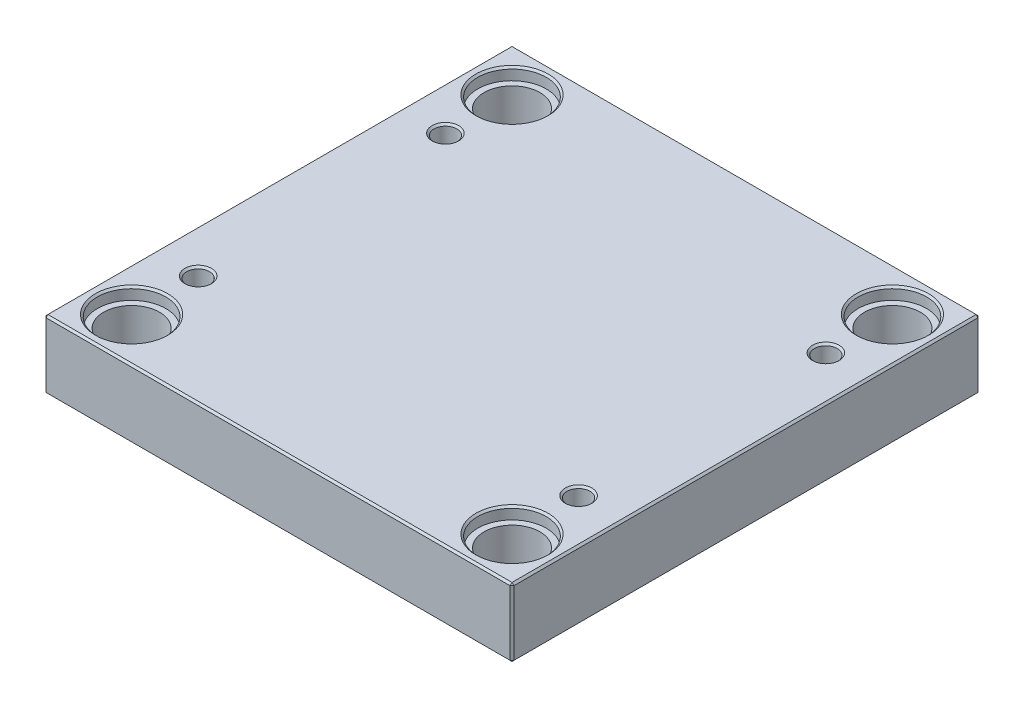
ISO-10303-21;
HEADER;
FILE_DESCRIPTION(('STEP AP214'),'2;1');
FILE_NAME('part.step','',(''),(''),'','','');
FILE_SCHEMA(('AUTOMOTIVE_DESIGN { 1 0 10303 214 1 1 1 1 }'));
ENDSEC;
DATA;
#1=APPLICATION_CONTEXT('core data for automotive mechanical design processes');
#2=APPLICATION_PROTOCOL_DEFINITION('international standard','automotive_design',2000,#1);
#3=PRODUCT_CONTEXT('',#1,'mechanical');
#4=PRODUCT('Part','Part','',(#3));
#5=PRODUCT_RELATED_PRODUCT_CATEGORY('part','',(#4));
#6=PRODUCT_DEFINITION_FORMATION('','',#4);
#7=PRODUCT_DEFINITION_CONTEXT('part definition',#1,'design');
#8=PRODUCT_DEFINITION('design','',#6,#7);
#9=PRODUCT_DEFINITION_SHAPE('','',#8);
#10=(LENGTH_UNIT() NAMED_UNIT(*) SI_UNIT(.MILLI.,.METRE.));
#11=(NAMED_UNIT(*) PLANE_ANGLE_UNIT() SI_UNIT($,.RADIAN.));
#12=(NAMED_UNIT(*) SI_UNIT($,.STERADIAN.) SOLID_ANGLE_UNIT());
#13=UNCERTAINTY_MEASURE_WITH_UNIT(LENGTH_MEASURE(1.E-05),#10,'distance_accuracy_value','');
#14=(GEOMETRIC_REPRESENTATION_CONTEXT(3) GLOBAL_UNCERTAINTY_ASSIGNED_CONTEXT((#13)) GLOBAL_UNIT_ASSIGNED_CONTEXT((#10,
#11,#12)) REPRESENTATION_CONTEXT('',''));
#15=CARTESIAN_POINT('',(0.,0.,0.));
#16=DIRECTION('',(0.,0.,1.));
#17=DIRECTION('',(1.,0.,0.));
#18=AXIS2_PLACEMENT_3D('',#15,#16,#17);
#19=CARTESIAN_POINT('',(-100.,0.,-100.));
#20=DIRECTION('',(0.,1.,0.));
#21=DIRECTION('',(0.,0.,1.));
#22=AXIS2_PLACEMENT_3D('',#19,#20,#21);
#23=CYLINDRICAL_SURFACE('',#22,14.7);
#24=CARTESIAN_POINT('',(-100.,1.00000000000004,-100.));
#25=DIRECTION('',(0.,1.,0.));
#26=DIRECTION('',(0.,0.,1.));
#27=AXIS2_PLACEMENT_3D('',#24,#25,#26);
#28=CIRCLE('',#27,14.7);
#29=CARTESIAN_POINT('',(-100.,1.00000000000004,-85.3));
#30=VERTEX_POINT('',#29);
#31=EDGE_CURVE('E472',#30,#30,#28,.F.);
#32=ORIENTED_EDGE('',*,*,#31,.T.);
#33=EDGE_LOOP('',(#32));
#34=FACE_BOUND('',#33,.T.);
#35=CARTESIAN_POINT('',(-100.,29.7,-100.));
#36=DIRECTION('',(0.,1.,0.));
#37=DIRECTION('',(0.,0.,1.));
#38=AXIS2_PLACEMENT_3D('',#35,#36,#37);
#39=CIRCLE('',#38,14.7);
#40=CARTESIAN_POINT('',(-100.,29.7,-85.3));
#41=VERTEX_POINT('',#40);
#42=EDGE_CURVE('E221',#41,#41,#39,.F.);
#43=ORIENTED_EDGE('',*,*,#42,.F.);
#44=EDGE_LOOP('',(#43));
#45=FACE_BOUND('',#44,.T.);
#46=ADVANCED_FACE('F16',(#34,#45),#23,.F.);
#47=CARTESIAN_POINT('',(100.,0.,-100.));
#48=DIRECTION('',(0.,1.,0.));
#49=DIRECTION('',(0.,0.,1.));
#50=AXIS2_PLACEMENT_3D('',#47,#48,#49);
#51=CYLINDRICAL_SURFACE('',#50,14.7);
#52=CARTESIAN_POINT('',(100.,1.00000000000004,-100.));
#53=DIRECTION('',(0.,1.,0.));
#54=DIRECTION('',(0.,0.,1.));
#55=AXIS2_PLACEMENT_3D('',#52,#53,#54);
#56=CIRCLE('',#55,14.7);
#57=CARTESIAN_POINT('',(100.,1.00000000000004,-85.3));
#58=VERTEX_POINT('',#57);
#59=EDGE_CURVE('E474',#58,#58,#56,.F.);
#60=ORIENTED_EDGE('',*,*,#59,.T.);
#61=EDGE_LOOP('',(#60));
#62=FACE_BOUND('',#61,.T.);
#63=CARTESIAN_POINT('',(100.,29.7,-100.));
#64=DIRECTION('',(0.,1.,0.));
#65=DIRECTION('',(0.,0.,1.));
#66=AXIS2_PLACEMENT_3D('',#63,#64,#65);
#67=CIRCLE('',#66,14.7);
#68=CARTESIAN_POINT('',(100.,29.7,-85.3));
#69=VERTEX_POINT('',#68);
#70=EDGE_CURVE('E218',#69,#69,#67,.F.);
#71=ORIENTED_EDGE('',*,*,#70,.F.);
#72=EDGE_LOOP('',(#71));
#73=FACE_BOUND('',#72,.T.);
#74=ADVANCED_FACE('F263',(#62,#73),#51,.F.);
#75=CARTESIAN_POINT('',(100.,0.,100.));
#76=DIRECTION('',(0.,1.,0.));
#77=DIRECTION('',(0.,0.,1.));
#78=AXIS2_PLACEMENT_3D('',#75,#76,#77);
#79=CYLINDRICAL_SURFACE('',#78,14.7);
#80=CARTESIAN_POINT('',(100.,1.00000000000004,100.));
#81=DIRECTION('',(0.,1.,0.));
#82=DIRECTION('',(0.,0.,1.));
#83=AXIS2_PLACEMENT_3D('',#80,#81,#82);
#84=CIRCLE('',#83,14.7);
#85=CARTESIAN_POINT('',(100.,1.00000000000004,114.7));
#86=VERTEX_POINT('',#85);
#87=EDGE_CURVE('E477',#86,#86,#84,.F.);
#88=ORIENTED_EDGE('',*,*,#87,.T.);
#89=EDGE_LOOP('',(#88));
#90=FACE_BOUND('',#89,.T.);
#91=CARTESIAN_POINT('',(100.,29.7,100.));
#92=DIRECTION('',(0.,1.,0.));
#93=DIRECTION('',(0.,0.,1.));
#94=AXIS2_PLACEMENT_3D('',#91,#92,#93);
#95=CIRCLE('',#94,14.7);
#96=CARTESIAN_POINT('',(100.,29.7,114.7));
#97=VERTEX_POINT('',#96);
#98=EDGE_CURVE('E214',#97,#97,#95,.F.);
#99=ORIENTED_EDGE('',*,*,#98,.F.);
#100=EDGE_LOOP('',(#99));
#101=FACE_BOUND('',#100,.T.);
#102=ADVANCED_FACE('F270',(#90,#101),#79,.F.);
#103=CARTESIAN_POINT('',(-100.,0.,100.));
#104=DIRECTION('',(0.,1.,0.));
#105=DIRECTION('',(0.,0.,1.));
#106=AXIS2_PLACEMENT_3D('',#103,#104,#105);
#107=CYLINDRICAL_SURFACE('',#106,14.7);
#108=CARTESIAN_POINT('',(-100.,1.00000000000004,100.));
#109=DIRECTION('',(0.,1.,0.));
#110=DIRECTION('',(0.,0.,1.));
#111=AXIS2_PLACEMENT_3D('',#108,#109,#110);
#112=CIRCLE('',#111,14.7);
#113=CARTESIAN_POINT('',(-100.,1.00000000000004,114.7));
#114=VERTEX_POINT('',#113);
#115=EDGE_CURVE('E480',#114,#114,#112,.F.);
#116=ORIENTED_EDGE('',*,*,#115,.T.);
#117=EDGE_LOOP('',(#116));
#118=FACE_BOUND('',#117,.T.);
#119=CARTESIAN_POINT('',(-100.,29.7,100.));
#120=DIRECTION('',(0.,1.,0.));
#121=DIRECTION('',(0.,0.,1.));
#122=AXIS2_PLACEMENT_3D('',#119,#120,#121);
#123=CIRCLE('',#122,14.7);
#124=CARTESIAN_POINT('',(-100.,29.7,114.7));
#125=VERTEX_POINT('',#124);
#126=EDGE_CURVE('E211',#125,#125,#123,.F.);
#127=ORIENTED_EDGE('',*,*,#126,.F.);
#128=EDGE_LOOP('',(#127));
#129=FACE_BOUND('',#128,.T.);
#130=ADVANCED_FACE('F277',(#118,#129),#107,.F.);
#131=CARTESIAN_POINT('',(-123.,36.,123.));
#132=DIRECTION('',(1.,0.,0.));
#133=DIRECTION('',(0.,0.,-1.));
#134=AXIS2_PLACEMENT_3D('',#131,#132,#133);
#135=PLANE('',#134);
#136=DIRECTION('',(0.,-1.,0.));
#137=VECTOR('',#136,1.);
#138=CARTESIAN_POINT('',(-123.,36.,-122.));
#139=LINE('',#138,#137);
#140=CARTESIAN_POINT('',(-123.,35.,-122.));
#141=VERTEX_POINT('',#140);
#142=CARTESIAN_POINT('',(-123.,0.999999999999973,-122.));
#143=VERTEX_POINT('',#142);
#144=EDGE_CURVE('E487',#141,#143,#139,.T.);
#145=ORIENTED_EDGE('',*,*,#144,.T.);
#146=DIRECTION('',(0.,0.,1.));
#147=VECTOR('',#146,1.);
#148=CARTESIAN_POINT('',(-123.,0.999999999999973,123.));
#149=LINE('',#148,#147);
#150=CARTESIAN_POINT('',(-123.,0.999999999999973,122.));
#151=VERTEX_POINT('',#150);
#152=EDGE_CURVE('E490',#143,#151,#149,.T.);
#153=ORIENTED_EDGE('',*,*,#152,.T.);
#154=DIRECTION('',(0.,1.,0.));
#155=VECTOR('',#154,1.);
#156=CARTESIAN_POINT('',(-123.,36.,122.));
#157=LINE('',#156,#155);
#158=CARTESIAN_POINT('',(-123.,35.,122.));
#159=VERTEX_POINT('',#158);
#160=EDGE_CURVE('E485',#151,#159,#157,.T.);
#161=ORIENTED_EDGE('',*,*,#160,.T.);
#162=DIRECTION('',(0.,0.,-1.));
#163=VECTOR('',#162,1.);
#164=CARTESIAN_POINT('',(-123.,35.,-123.));
#165=LINE('',#164,#163);
#166=EDGE_CURVE('E483',#159,#141,#165,.T.);
#167=ORIENTED_EDGE('',*,*,#166,.T.);
#168=EDGE_LOOP('',(#145,#153,#161,#167));
#169=FACE_BOUND('',#168,.T.);
#170=ADVANCED_FACE('F298',(#169),#135,.F.);
#171=CARTESIAN_POINT('',(123.,36.,123.));
#172=DIRECTION('',(0.,0.,-1.));
#173=DIRECTION('',(-1.,0.,0.));
#174=AXIS2_PLACEMENT_3D('',#171,#172,#173);
#175=PLANE('',#174);
#176=DIRECTION('',(-1.,0.,0.));
#177=VECTOR('',#176,1.);
#178=CARTESIAN_POINT('',(-123.,35.,123.));
#179=LINE('',#178,#177);
#180=CARTESIAN_POINT('',(122.,35.,123.));
#181=VERTEX_POINT('',#180);
#182=CARTESIAN_POINT('',(-122.,35.,123.));
#183=VERTEX_POINT('',#182);
#184=EDGE_CURVE('E509',#181,#183,#179,.T.);
#185=ORIENTED_EDGE('',*,*,#184,.T.);
#186=DIRECTION('',(0.,-1.,0.));
#187=VECTOR('',#186,1.);
#188=CARTESIAN_POINT('',(-122.,36.,123.));
#189=LINE('',#188,#187);
#190=CARTESIAN_POINT('',(-122.,0.999999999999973,123.));
#191=VERTEX_POINT('',#190);
#192=EDGE_CURVE('E515',#183,#191,#189,.T.);
#193=ORIENTED_EDGE('',*,*,#192,.T.);
#194=DIRECTION('',(1.,0.,0.));
#195=VECTOR('',#194,1.);
#196=CARTESIAN_POINT('',(123.,0.999999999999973,123.));
#197=LINE('',#196,#195);
#198=CARTESIAN_POINT('',(122.,0.999999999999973,123.));
#199=VERTEX_POINT('',#198);
#200=EDGE_CURVE('E513',#191,#199,#197,.T.);
#201=ORIENTED_EDGE('',*,*,#200,.T.);
#202=DIRECTION('',(0.,1.,0.));
#203=VECTOR('',#202,1.);
#204=CARTESIAN_POINT('',(122.,36.,123.));
#205=LINE('',#204,#203);
#206=EDGE_CURVE('E511',#199,#181,#205,.T.);
#207=ORIENTED_EDGE('',*,*,#206,.T.);
#208=EDGE_LOOP('',(#185,#193,#201,#207));
#209=FACE_BOUND('',#208,.T.);
#210=ADVANCED_FACE('F294',(#209),#175,.F.);
#211=CARTESIAN_POINT('',(123.,36.,123.));
#212=DIRECTION('',(-1.,0.,0.));
#213=DIRECTION('',(0.,0.,1.));
#214=AXIS2_PLACEMENT_3D('',#211,#212,#213);
#215=PLANE('',#214);
#216=DIRECTION('',(0.,0.,-1.));
#217=VECTOR('',#216,1.);
#218=CARTESIAN_POINT('',(123.,0.999999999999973,123.));
#219=LINE('',#218,#217);
#220=CARTESIAN_POINT('',(123.,0.999999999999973,122.));
#221=VERTEX_POINT('',#220);
#222=CARTESIAN_POINT('',(123.,0.999999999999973,-122.));
#223=VERTEX_POINT('',#222);
#224=EDGE_CURVE('E504',#221,#223,#219,.T.);
#225=ORIENTED_EDGE('',*,*,#224,.T.);
#226=DIRECTION('',(0.,1.,0.));
#227=VECTOR('',#226,1.);
#228=CARTESIAN_POINT('',(123.,36.,-122.));
#229=LINE('',#228,#227);
#230=CARTESIAN_POINT('',(123.,35.,-122.));
#231=VERTEX_POINT('',#230);
#232=EDGE_CURVE('E506',#223,#231,#229,.T.);
#233=ORIENTED_EDGE('',*,*,#232,.T.);
#234=DIRECTION('',(0.,0.,1.));
#235=VECTOR('',#234,1.);
#236=CARTESIAN_POINT('',(123.,35.,123.));
#237=LINE('',#236,#235);
#238=CARTESIAN_POINT('',(123.,35.,122.));
#239=VERTEX_POINT('',#238);
#240=EDGE_CURVE('E500',#231,#239,#237,.T.);
#241=ORIENTED_EDGE('',*,*,#240,.T.);
#242=DIRECTION('',(0.,-1.,0.));
#243=VECTOR('',#242,1.);
#244=CARTESIAN_POINT('',(123.,36.,122.));
#245=LINE('',#244,#243);
#246=EDGE_CURVE('E502',#239,#221,#245,.T.);
#247=ORIENTED_EDGE('',*,*,#246,.T.);
#248=EDGE_LOOP('',(#225,#233,#241,#247));
#249=FACE_BOUND('',#248,.T.);
#250=ADVANCED_FACE('F290',(#249),#215,.F.);
#251=CARTESIAN_POINT('',(123.,36.,-123.));
#252=DIRECTION('',(0.,0.,1.));
#253=DIRECTION('',(1.,0.,0.));
#254=AXIS2_PLACEMENT_3D('',#251,#252,#253);
#255=PLANE('',#254);
#256=DIRECTION('',(0.,-1.,0.));
#257=VECTOR('',#256,1.);
#258=CARTESIAN_POINT('',(122.,36.,-123.));
#259=LINE('',#258,#257);
#260=CARTESIAN_POINT('',(122.,35.,-123.));
#261=VERTEX_POINT('',#260);
#262=CARTESIAN_POINT('',(122.,0.999999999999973,-123.));
#263=VERTEX_POINT('',#262);
#264=EDGE_CURVE('E494',#261,#263,#259,.T.);
#265=ORIENTED_EDGE('',*,*,#264,.T.);
#266=DIRECTION('',(-1.,0.,0.));
#267=VECTOR('',#266,1.);
#268=CARTESIAN_POINT('',(123.,0.999999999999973,-123.));
#269=LINE('',#268,#267);
#270=CARTESIAN_POINT('',(-122.,0.999999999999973,-123.));
#271=VERTEX_POINT('',#270);
#272=EDGE_CURVE('E138',#263,#271,#269,.T.);
#273=ORIENTED_EDGE('',*,*,#272,.T.);
#274=DIRECTION('',(0.,1.,0.));
#275=VECTOR('',#274,1.);
#276=CARTESIAN_POINT('',(-122.,36.,-123.));
#277=LINE('',#276,#275);
#278=CARTESIAN_POINT('',(-122.,35.,-123.));
#279=VERTEX_POINT('',#278);
#280=EDGE_CURVE('E496',#271,#279,#277,.T.);
#281=ORIENTED_EDGE('',*,*,#280,.T.);
#282=DIRECTION('',(1.,0.,0.));
#283=VECTOR('',#282,1.);
#284=CARTESIAN_POINT('',(123.,35.,-123.));
#285=LINE('',#284,#283);
#286=EDGE_CURVE('E492',#279,#261,#285,.T.);
#287=ORIENTED_EDGE('',*,*,#286,.T.);
#288=EDGE_LOOP('',(#265,#273,#281,#287));
#289=FACE_BOUND('',#288,.T.);
#290=ADVANCED_FACE('F282',(#289),#255,.F.);
#291=CARTESIAN_POINT('',(0.,36.,0.));
#292=DIRECTION('',(0.,1.,0.));
#293=DIRECTION('',(0.,0.,1.));
#294=AXIS2_PLACEMENT_3D('',#291,#292,#293);
#295=PLANE('',#294);
#296=CARTESIAN_POINT('',(100.,36.,100.));
#297=DIRECTION('',(0.,1.,0.));
#298=DIRECTION('',(0.,0.,1.));
#299=AXIS2_PLACEMENT_3D('',#296,#297,#298);
#300=CIRCLE('',#299,19.);
#301=CARTESIAN_POINT('',(100.,36.,119.));
#302=VERTEX_POINT('',#301);
#303=EDGE_CURVE('E236',#302,#302,#300,.F.);
#304=ORIENTED_EDGE('',*,*,#303,.T.);
#305=EDGE_LOOP('',(#304));
#306=FACE_BOUND('',#305,.T.);
#307=CARTESIAN_POINT('',(-100.,36.,100.));
#308=DIRECTION('',(0.,1.,0.));
#309=DIRECTION('',(0.,0.,1.));
#310=AXIS2_PLACEMENT_3D('',#307,#308,#309);
#311=CIRCLE('',#310,19.);
#312=CARTESIAN_POINT('',(-100.,36.,119.));
#313=VERTEX_POINT('',#312);
#314=EDGE_CURVE('E233',#313,#313,#311,.F.);
#315=ORIENTED_EDGE('',*,*,#314,.T.);
#316=EDGE_LOOP('',(#315));
#317=FACE_BOUND('',#316,.T.);
#318=CARTESIAN_POINT('',(100.,36.,-100.));
#319=DIRECTION('',(0.,1.,0.));
#320=DIRECTION('',(0.,0.,1.));
#321=AXIS2_PLACEMENT_3D('',#318,#319,#320);
#322=CIRCLE('',#321,19.);
#323=CARTESIAN_POINT('',(100.,36.,-81.));
#324=VERTEX_POINT('',#323);
#325=EDGE_CURVE('E230',#324,#324,#322,.F.);
#326=ORIENTED_EDGE('',*,*,#325,.T.);
#327=EDGE_LOOP('',(#326));
#328=FACE_BOUND('',#327,.T.);
#329=CARTESIAN_POINT('',(-100.,36.,-100.));
#330=DIRECTION('',(0.,1.,0.));
#331=DIRECTION('',(0.,0.,1.));
#332=AXIS2_PLACEMENT_3D('',#329,#330,#331);
#333=CIRCLE('',#332,19.);
#334=CARTESIAN_POINT('',(-100.,36.,-81.));
#335=VERTEX_POINT('',#334);
#336=EDGE_CURVE('E227',#335,#335,#333,.F.);
#337=ORIENTED_EDGE('',*,*,#336,.T.);
#338=EDGE_LOOP('',(#337));
#339=FACE_BOUND('',#338,.T.);
#340=CARTESIAN_POINT('',(-100.,36.,65.));
#341=DIRECTION('',(0.,1.,0.));
#342=DIRECTION('',(0.,0.,1.));
#343=AXIS2_PLACEMENT_3D('',#340,#341,#342);
#344=CIRCLE('',#343,7.);
#345=CARTESIAN_POINT('',(-100.,36.,72.));
#346=VERTEX_POINT('',#345);
#347=EDGE_CURVE('E198',#346,#346,#344,.F.);
#348=ORIENTED_EDGE('',*,*,#347,.T.);
#349=EDGE_LOOP('',(#348));
#350=FACE_BOUND('',#349,.T.);
#351=CARTESIAN_POINT('',(100.,36.,65.));
#352=DIRECTION('',(0.,1.,0.));
#353=DIRECTION('',(0.,0.,1.));
#354=AXIS2_PLACEMENT_3D('',#351,#352,#353);
#355=CIRCLE('',#354,7.);
#356=CARTESIAN_POINT('',(100.,36.,72.));
#357=VERTEX_POINT('',#356);
#358=EDGE_CURVE('E195',#357,#357,#355,.F.);
#359=ORIENTED_EDGE('',*,*,#358,.T.);
#360=EDGE_LOOP('',(#359));
#361=FACE_BOUND('',#360,.T.);
#362=CARTESIAN_POINT('',(100.,36.,-65.));
#363=DIRECTION('',(0.,1.,0.));
#364=DIRECTION('',(0.,0.,1.));
#365=AXIS2_PLACEMENT_3D('',#362,#363,#364);
#366=CIRCLE('',#365,7.);
#367=CARTESIAN_POINT('',(100.,36.,-58.));
#368=VERTEX_POINT('',#367);
#369=EDGE_CURVE('E192',#368,#368,#366,.F.);
#370=ORIENTED_EDGE('',*,*,#369,.T.);
#371=EDGE_LOOP('',(#370));
#372=FACE_BOUND('',#371,.T.);
#373=CARTESIAN_POINT('',(-100.,36.,-65.));
#374=DIRECTION('',(0.,1.,0.));
#375=DIRECTION('',(0.,0.,1.));
#376=AXIS2_PLACEMENT_3D('',#373,#374,#375);
#377=CIRCLE('',#376,7.);
#378=CARTESIAN_POINT('',(-100.,36.,-58.));
#379=VERTEX_POINT('',#378);
#380=EDGE_CURVE('E188',#379,#379,#377,.F.);
#381=ORIENTED_EDGE('',*,*,#380,.T.);
#382=EDGE_LOOP('',(#381));
#383=FACE_BOUND('',#382,.T.);
#384=DIRECTION('',(0.,0.,-1.));
#385=VECTOR('',#384,1.);
#386=CARTESIAN_POINT('',(122.,36.,-123.));
#387=LINE('',#386,#385);
#388=CARTESIAN_POINT('',(122.,36.,122.));
#389=VERTEX_POINT('',#388);
#390=CARTESIAN_POINT('',(122.,36.,-122.));
#391=VERTEX_POINT('',#390);
#392=EDGE_CURVE('E31',#389,#391,#387,.T.);
#393=ORIENTED_EDGE('',*,*,#392,.T.);
#394=DIRECTION('',(-1.,0.,0.));
#395=VECTOR('',#394,1.);
#396=CARTESIAN_POINT('',(-123.,36.,-122.));
#397=LINE('',#396,#395);
#398=CARTESIAN_POINT('',(-122.,36.,-122.));
#399=VERTEX_POINT('',#398);
#400=EDGE_CURVE('E189',#391,#399,#397,.T.);
#401=ORIENTED_EDGE('',*,*,#400,.T.);
#402=DIRECTION('',(0.,0.,1.));
#403=VECTOR('',#402,1.);
#404=CARTESIAN_POINT('',(-122.,36.,123.));
#405=LINE('',#404,#403);
#406=CARTESIAN_POINT('',(-122.,36.,122.));
#407=VERTEX_POINT('',#406);
#408=EDGE_CURVE('E518',#399,#407,#405,.T.);
#409=ORIENTED_EDGE('',*,*,#408,.T.);
#410=DIRECTION('',(1.,0.,0.));
#411=VECTOR('',#410,1.);
#412=CARTESIAN_POINT('',(123.,36.,122.));
#413=LINE('',#412,#411);
#414=EDGE_CURVE('E36',#407,#389,#413,.T.);
#415=ORIENTED_EDGE('',*,*,#414,.T.);
#416=EDGE_LOOP('',(#393,#401,#409,#415));
#417=FACE_BOUND('',#416,.T.);
#418=ADVANCED_FACE('F279',(#306,#317,#328,#339,#350,#361,#372,#383,#417),#295,.T.);
#419=CARTESIAN_POINT('',(0.,0.,0.));
#420=DIRECTION('',(0.,1.,0.));
#421=DIRECTION('',(0.,0.,1.));
#422=AXIS2_PLACEMENT_3D('',#419,#420,#421);
#423=PLANE('',#422);
#424=CARTESIAN_POINT('',(-100.,0.,-100.));
#425=DIRECTION('',(0.,1.,0.));
#426=DIRECTION('',(0.,0.,1.));
#427=AXIS2_PLACEMENT_3D('',#424,#425,#426);
#428=CIRCLE('',#427,15.7);
#429=CARTESIAN_POINT('',(-100.,0.,-84.3));
#430=VERTEX_POINT('',#429);
#431=EDGE_CURVE('E469',#430,#430,#428,.T.);
#432=ORIENTED_EDGE('',*,*,#431,.T.);
#433=EDGE_LOOP('',(#432));
#434=FACE_BOUND('',#433,.T.);
#435=CARTESIAN_POINT('',(100.,0.,-100.));
#436=DIRECTION('',(0.,1.,0.));
#437=DIRECTION('',(0.,0.,1.));
#438=AXIS2_PLACEMENT_3D('',#435,#436,#437);
#439=CIRCLE('',#438,15.7);
#440=CARTESIAN_POINT('',(100.,0.,-84.3));
#441=VERTEX_POINT('',#440);
#442=EDGE_CURVE('E466',#441,#441,#439,.T.);
#443=ORIENTED_EDGE('',*,*,#442,.T.);
#444=EDGE_LOOP('',(#443));
#445=FACE_BOUND('',#444,.T.);
#446=CARTESIAN_POINT('',(100.,0.,100.));
#447=DIRECTION('',(0.,1.,0.));
#448=DIRECTION('',(0.,0.,1.));
#449=AXIS2_PLACEMENT_3D('',#446,#447,#448);
#450=CIRCLE('',#449,15.7);
#451=CARTESIAN_POINT('',(100.,0.,115.7));
#452=VERTEX_POINT('',#451);
#453=EDGE_CURVE('E463',#452,#452,#450,.T.);
#454=ORIENTED_EDGE('',*,*,#453,.T.);
#455=EDGE_LOOP('',(#454));
#456=FACE_BOUND('',#455,.T.);
#457=CARTESIAN_POINT('',(-100.,0.,100.));
#458=DIRECTION('',(0.,1.,0.));
#459=DIRECTION('',(0.,0.,1.));
#460=AXIS2_PLACEMENT_3D('',#457,#458,#459);
#461=CIRCLE('',#460,15.7);
#462=CARTESIAN_POINT('',(-100.,0.,115.7));
#463=VERTEX_POINT('',#462);
#464=EDGE_CURVE('E460',#463,#463,#461,.T.);
#465=ORIENTED_EDGE('',*,*,#464,.T.);
#466=EDGE_LOOP('',(#465));
#467=FACE_BOUND('',#466,.T.);
#468=DIRECTION('',(0.,0.,1.));
#469=VECTOR('',#468,1.);
#470=CARTESIAN_POINT('',(122.,0.,0.));
#471=LINE('',#470,#469);
#472=CARTESIAN_POINT('',(122.,0.,-122.));
#473=VERTEX_POINT('',#472);
#474=CARTESIAN_POINT('',(122.,0.,122.));
#475=VERTEX_POINT('',#474);
#476=EDGE_CURVE('E108',#473,#475,#471,.T.);
#477=ORIENTED_EDGE('',*,*,#476,.T.);
#478=DIRECTION('',(-1.,0.,0.));
#479=VECTOR('',#478,1.);
#480=CARTESIAN_POINT('',(0.,0.,122.));
#481=LINE('',#480,#479);
#482=CARTESIAN_POINT('',(-122.,0.,122.));
#483=VERTEX_POINT('',#482);
#484=EDGE_CURVE('E458',#475,#483,#481,.T.);
#485=ORIENTED_EDGE('',*,*,#484,.T.);
#486=DIRECTION('',(0.,0.,-1.));
#487=VECTOR('',#486,1.);
#488=CARTESIAN_POINT('',(-122.,0.,0.));
#489=LINE('',#488,#487);
#490=CARTESIAN_POINT('',(-122.,0.,-122.));
#491=VERTEX_POINT('',#490);
#492=EDGE_CURVE('E110',#483,#491,#489,.T.);
#493=ORIENTED_EDGE('',*,*,#492,.T.);
#494=DIRECTION('',(1.,0.,0.));
#495=VECTOR('',#494,1.);
#496=CARTESIAN_POINT('',(0.,0.,-122.));
#497=LINE('',#496,#495);
#498=EDGE_CURVE('E104',#491,#473,#497,.T.);
#499=ORIENTED_EDGE('',*,*,#498,.T.);
#500=EDGE_LOOP('',(#477,#485,#493,#499));
#501=FACE_BOUND('',#500,.T.);
#502=ADVANCED_FACE('F106',(#434,#445,#456,#467,#501),#423,.F.);
#503=CARTESIAN_POINT('',(-100.,0.,-100.));
#504=DIRECTION('',(0.,-1.,0.));
#505=DIRECTION('',(0.,0.,-1.));
#506=AXIS2_PLACEMENT_3D('',#503,#504,#505);
#507=CONICAL_SURFACE('',#506,15.7,0.785398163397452);
#508=ORIENTED_EDGE('',*,*,#31,.F.);
#509=EDGE_LOOP('',(#508));
#510=FACE_BOUND('',#509,.T.);
#511=ORIENTED_EDGE('',*,*,#431,.F.);
#512=EDGE_LOOP('',(#511));
#513=FACE_BOUND('',#512,.T.);
#514=ADVANCED_FACE('F286',(#510,#513),#507,.F.);
#515=CARTESIAN_POINT('',(100.,0.,-100.));
#516=DIRECTION('',(0.,-1.,0.));
#517=DIRECTION('',(0.,0.,-1.));
#518=AXIS2_PLACEMENT_3D('',#515,#516,#517);
#519=CONICAL_SURFACE('',#518,15.7,0.785398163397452);
#520=ORIENTED_EDGE('',*,*,#59,.F.);
#521=EDGE_LOOP('',(#520));
#522=FACE_BOUND('',#521,.T.);
#523=ORIENTED_EDGE('',*,*,#442,.F.);
#524=EDGE_LOOP('',(#523));
#525=FACE_BOUND('',#524,.T.);
#526=ADVANCED_FACE('F305',(#522,#525),#519,.F.);
#527=CARTESIAN_POINT('',(100.,0.,100.));
#528=DIRECTION('',(0.,-1.,0.));
#529=DIRECTION('',(0.,0.,-1.));
#530=AXIS2_PLACEMENT_3D('',#527,#528,#529);
#531=CONICAL_SURFACE('',#530,15.7,0.785398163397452);
#532=ORIENTED_EDGE('',*,*,#87,.F.);
#533=EDGE_LOOP('',(#532));
#534=FACE_BOUND('',#533,.T.);
#535=ORIENTED_EDGE('',*,*,#453,.F.);
#536=EDGE_LOOP('',(#535));
#537=FACE_BOUND('',#536,.T.);
#538=ADVANCED_FACE('F309',(#534,#537),#531,.F.);
#539=CARTESIAN_POINT('',(-100.,0.,100.));
#540=DIRECTION('',(0.,-1.,0.));
#541=DIRECTION('',(0.,0.,-1.));
#542=AXIS2_PLACEMENT_3D('',#539,#540,#541);
#543=CONICAL_SURFACE('',#542,15.7,0.785398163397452);
#544=ORIENTED_EDGE('',*,*,#115,.F.);
#545=EDGE_LOOP('',(#544));
#546=FACE_BOUND('',#545,.T.);
#547=ORIENTED_EDGE('',*,*,#464,.F.);
#548=EDGE_LOOP('',(#547));
#549=FACE_BOUND('',#548,.T.);
#550=ADVANCED_FACE('F313',(#546,#549),#543,.F.);
#551=CARTESIAN_POINT('',(123.,36.,122.));
#552=DIRECTION('',(-0.707106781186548,0.,-0.707106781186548));
#553=DIRECTION('',(0.,-1.,0.));
#554=AXIS2_PLACEMENT_3D('',#551,#552,#553);
#555=PLANE('',#554);
#556=DIRECTION('',(-0.707106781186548,0.,0.707106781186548));
#557=VECTOR('',#556,1.);
#558=CARTESIAN_POINT('',(122.,35.,123.));
#559=LINE('',#558,#557);
#560=EDGE_CURVE('E126',#181,#239,#559,.F.);
#561=ORIENTED_EDGE('',*,*,#560,.F.);
#562=ORIENTED_EDGE('',*,*,#206,.F.);
#563=DIRECTION('',(0.707106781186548,0.,-0.707106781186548));
#564=VECTOR('',#563,1.);
#565=CARTESIAN_POINT('',(122.,0.999999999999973,123.));
#566=LINE('',#565,#564);
#567=EDGE_CURVE('E180',#221,#199,#566,.F.);
#568=ORIENTED_EDGE('',*,*,#567,.F.);
#569=ORIENTED_EDGE('',*,*,#246,.F.);
#570=EDGE_LOOP('',(#561,#562,#568,#569));
#571=FACE_BOUND('',#570,.T.);
#572=ADVANCED_FACE('F317',(#571),#555,.F.);
#573=CARTESIAN_POINT('',(122.,35.,123.));
#574=DIRECTION('',(0.577350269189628,0.577350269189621,0.577350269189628));
#575=DIRECTION('',(0.707106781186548,0.,-0.707106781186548));
#576=AXIS2_PLACEMENT_3D('',#573,#574,#575);
#577=PLANE('',#576);
#578=DIRECTION('',(0.,-0.70710678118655,0.707106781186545));
#579=VECTOR('',#578,1.);
#580=CARTESIAN_POINT('',(122.,35.,123.));
#581=LINE('',#580,#579);
#582=EDGE_CURVE('E175',#181,#389,#581,.F.);
#583=ORIENTED_EDGE('',*,*,#582,.F.);
#584=ORIENTED_EDGE('',*,*,#560,.T.);
#585=DIRECTION('',(-0.707106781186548,0.707106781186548,0.));
#586=VECTOR('',#585,1.);
#587=CARTESIAN_POINT('',(122.5,35.5,122.));
#588=LINE('',#587,#586);
#589=EDGE_CURVE('E177',#389,#239,#588,.F.);
#590=ORIENTED_EDGE('',*,*,#589,.F.);
#591=EDGE_LOOP('',(#583,#584,#590));
#592=FACE_BOUND('',#591,.T.);
#593=ADVANCED_FACE('F385',(#592),#577,.T.);
#594=CARTESIAN_POINT('',(122.,0.999999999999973,123.));
#595=DIRECTION('',(0.577350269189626,-0.577350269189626,0.577350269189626));
#596=DIRECTION('',(0.707106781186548,0.,-0.707106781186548));
#597=AXIS2_PLACEMENT_3D('',#594,#595,#596);
#598=PLANE('',#597);
#599=DIRECTION('',(-0.707106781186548,-0.707106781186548,0.));
#600=VECTOR('',#599,1.);
#601=CARTESIAN_POINT('',(122.5,0.499999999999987,122.));
#602=LINE('',#601,#600);
#603=EDGE_CURVE('E124',#221,#475,#602,.T.);
#604=ORIENTED_EDGE('',*,*,#603,.F.);
#605=ORIENTED_EDGE('',*,*,#567,.T.);
#606=DIRECTION('',(0.,0.70710678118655,0.707106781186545));
#607=VECTOR('',#606,1.);
#608=CARTESIAN_POINT('',(122.,0.999999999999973,123.));
#609=LINE('',#608,#607);
#610=EDGE_CURVE('E172',#475,#199,#609,.T.);
#611=ORIENTED_EDGE('',*,*,#610,.F.);
#612=EDGE_LOOP('',(#604,#605,#611));
#613=FACE_BOUND('',#612,.T.);
#614=ADVANCED_FACE('F381',(#613),#598,.T.);
#615=CARTESIAN_POINT('',(122.,36.,0.));
#616=DIRECTION('',(0.707106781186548,0.707106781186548,0.));
#617=DIRECTION('',(0.,0.,1.));
#618=AXIS2_PLACEMENT_3D('',#615,#616,#617);
#619=PLANE('',#618);
#620=ORIENTED_EDGE('',*,*,#589,.T.);
#621=ORIENTED_EDGE('',*,*,#240,.F.);
#622=DIRECTION('',(0.707106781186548,-0.707106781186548,0.));
#623=VECTOR('',#622,1.);
#624=CARTESIAN_POINT('',(123.,35.,-122.));
#625=LINE('',#624,#623);
#626=EDGE_CURVE('E166',#391,#231,#625,.T.);
#627=ORIENTED_EDGE('',*,*,#626,.F.);
#628=ORIENTED_EDGE('',*,*,#392,.F.);
#629=EDGE_LOOP('',(#620,#621,#627,#628));
#630=FACE_BOUND('',#629,.T.);
#631=ADVANCED_FACE('F377',(#630),#619,.T.);
#632=CARTESIAN_POINT('',(0.,36.,122.));
#633=DIRECTION('',(0.,0.707106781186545,0.70710678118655));
#634=DIRECTION('',(-1.,0.,0.));
#635=AXIS2_PLACEMENT_3D('',#632,#633,#634);
#636=PLANE('',#635);
#637=ORIENTED_EDGE('',*,*,#582,.T.);
#638=ORIENTED_EDGE('',*,*,#414,.F.);
#639=DIRECTION('',(0.,0.70710678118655,-0.707106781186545));
#640=VECTOR('',#639,1.);
#641=CARTESIAN_POINT('',(-122.,35.5,122.5));
#642=LINE('',#641,#640);
#643=EDGE_CURVE('E163',#183,#407,#642,.T.);
#644=ORIENTED_EDGE('',*,*,#643,.F.);
#645=ORIENTED_EDGE('',*,*,#184,.F.);
#646=EDGE_LOOP('',(#637,#638,#644,#645));
#647=FACE_BOUND('',#646,.T.);
#648=ADVANCED_FACE('F373',(#647),#636,.T.);
#649=CARTESIAN_POINT('',(-122.,36.,123.));
#650=DIRECTION('',(0.707106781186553,0.,-0.707106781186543));
#651=DIRECTION('',(0.,-1.,0.));
#652=AXIS2_PLACEMENT_3D('',#649,#650,#651);
#653=PLANE('',#652);
#654=DIRECTION('',(0.707106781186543,0.,0.707106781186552));
#655=VECTOR('',#654,1.);
#656=CARTESIAN_POINT('',(-122.,0.999999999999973,123.));
#657=LINE('',#656,#655);
#658=EDGE_CURVE('E157',#191,#151,#657,.F.);
#659=ORIENTED_EDGE('',*,*,#658,.F.);
#660=ORIENTED_EDGE('',*,*,#192,.F.);
#661=DIRECTION('',(-0.707106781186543,0.,-0.707106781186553));
#662=VECTOR('',#661,1.);
#663=CARTESIAN_POINT('',(-123.,35.,122.));
#664=LINE('',#663,#662);
#665=EDGE_CURVE('E160',#159,#183,#664,.F.);
#666=ORIENTED_EDGE('',*,*,#665,.F.);
#667=ORIENTED_EDGE('',*,*,#160,.F.);
#668=EDGE_LOOP('',(#659,#660,#666,#667));
#669=FACE_BOUND('',#668,.T.);
#670=ADVANCED_FACE('F369',(#669),#653,.F.);
#671=CARTESIAN_POINT('',(123.,0.999999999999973,123.));
#672=DIRECTION('',(0.,0.707106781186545,-0.70710678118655));
#673=DIRECTION('',(1.,0.,0.));
#674=AXIS2_PLACEMENT_3D('',#671,#672,#673);
#675=PLANE('',#674);
#676=ORIENTED_EDGE('',*,*,#610,.T.);
#677=ORIENTED_EDGE('',*,*,#200,.F.);
#678=DIRECTION('',(0.,-0.70710678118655,-0.707106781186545));
#679=VECTOR('',#678,1.);
#680=CARTESIAN_POINT('',(-122.,0.999999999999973,123.));
#681=LINE('',#680,#679);
#682=EDGE_CURVE('E135',#483,#191,#681,.F.);
#683=ORIENTED_EDGE('',*,*,#682,.F.);
#684=ORIENTED_EDGE('',*,*,#484,.F.);
#685=EDGE_LOOP('',(#676,#677,#683,#684));
#686=FACE_BOUND('',#685,.T.);
#687=ADVANCED_FACE('F366',(#686),#675,.F.);
#688=CARTESIAN_POINT('',(123.,0.999999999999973,123.));
#689=DIRECTION('',(-0.707106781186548,0.707106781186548,0.));
#690=DIRECTION('',(0.,0.,-1.));
#691=AXIS2_PLACEMENT_3D('',#688,#689,#690);
#692=PLANE('',#691);
#693=ORIENTED_EDGE('',*,*,#603,.T.);
#694=ORIENTED_EDGE('',*,*,#476,.F.);
#695=DIRECTION('',(0.707106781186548,0.707106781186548,0.));
#696=VECTOR('',#695,1.);
#697=CARTESIAN_POINT('',(122.5,0.49999999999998,-122.));
#698=LINE('',#697,#696);
#699=EDGE_CURVE('E121',#223,#473,#698,.F.);
#700=ORIENTED_EDGE('',*,*,#699,.F.);
#701=ORIENTED_EDGE('',*,*,#224,.F.);
#702=EDGE_LOOP('',(#693,#694,#700,#701));
#703=FACE_BOUND('',#702,.T.);
#704=ADVANCED_FACE('F119',(#703),#692,.F.);
#705=CARTESIAN_POINT('',(122.,36.,-123.));
#706=DIRECTION('',(-0.707106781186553,0.,0.707106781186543));
#707=DIRECTION('',(0.,-1.,0.));
#708=AXIS2_PLACEMENT_3D('',#705,#706,#707);
#709=PLANE('',#708);
#710=DIRECTION('',(0.707106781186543,0.,0.707106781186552));
#711=VECTOR('',#710,1.);
#712=CARTESIAN_POINT('',(123.,35.,-122.));
#713=LINE('',#712,#711);
#714=EDGE_CURVE('E168',#231,#261,#713,.F.);
#715=ORIENTED_EDGE('',*,*,#714,.F.);
#716=ORIENTED_EDGE('',*,*,#232,.F.);
#717=DIRECTION('',(-0.707106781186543,0.,-0.707106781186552));
#718=VECTOR('',#717,1.);
#719=CARTESIAN_POINT('',(122.,0.999999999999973,-123.));
#720=LINE('',#719,#718);
#721=EDGE_CURVE('E134',#263,#223,#720,.F.);
#722=ORIENTED_EDGE('',*,*,#721,.F.);
#723=ORIENTED_EDGE('',*,*,#264,.F.);
#724=EDGE_LOOP('',(#715,#716,#722,#723));
#725=FACE_BOUND('',#724,.T.);
#726=ADVANCED_FACE('F359',(#725),#709,.F.);
#727=CARTESIAN_POINT('',(123.,35.,-122.));
#728=DIRECTION('',(0.577350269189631,0.577350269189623,-0.577350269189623));
#729=DIRECTION('',(-0.707106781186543,0.,-0.707106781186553));
#730=AXIS2_PLACEMENT_3D('',#727,#728,#729);
#731=PLANE('',#730);
#732=ORIENTED_EDGE('',*,*,#626,.T.);
#733=ORIENTED_EDGE('',*,*,#714,.T.);
#734=DIRECTION('',(0.,0.707106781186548,0.707106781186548));
#735=VECTOR('',#734,1.);
#736=CARTESIAN_POINT('',(122.,35.5,-122.5));
#737=LINE('',#736,#735);
#738=EDGE_CURVE('E152',#391,#261,#737,.F.);
#739=ORIENTED_EDGE('',*,*,#738,.F.);
#740=EDGE_LOOP('',(#732,#733,#739));
#741=FACE_BOUND('',#740,.T.);
#742=ADVANCED_FACE('F355',(#741),#731,.T.);
#743=CARTESIAN_POINT('',(-123.,35.,122.));
#744=DIRECTION('',(-0.577350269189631,0.577350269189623,0.577350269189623));
#745=DIRECTION('',(0.707106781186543,0.,0.707106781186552));
#746=AXIS2_PLACEMENT_3D('',#743,#744,#745);
#747=PLANE('',#746);
#748=ORIENTED_EDGE('',*,*,#665,.T.);
#749=ORIENTED_EDGE('',*,*,#643,.T.);
#750=DIRECTION('',(-0.707106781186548,-0.707106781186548,0.));
#751=VECTOR('',#750,1.);
#752=CARTESIAN_POINT('',(-123.,35.,122.));
#753=LINE('',#752,#751);
#754=EDGE_CURVE('E143',#159,#407,#753,.F.);
#755=ORIENTED_EDGE('',*,*,#754,.F.);
#756=EDGE_LOOP('',(#748,#749,#755));
#757=FACE_BOUND('',#756,.T.);
#758=ADVANCED_FACE('F351',(#757),#747,.T.);
#759=CARTESIAN_POINT('',(-122.,0.999999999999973,123.));
#760=DIRECTION('',(-0.577350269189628,-0.577350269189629,0.57735026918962));
#761=DIRECTION('',(0.707106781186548,-0.707106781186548,0.));
#762=AXIS2_PLACEMENT_3D('',#759,#760,#761);
#763=PLANE('',#762);
#764=ORIENTED_EDGE('',*,*,#682,.T.);
#765=ORIENTED_EDGE('',*,*,#658,.T.);
#766=DIRECTION('',(-0.707106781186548,0.707106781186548,0.));
#767=VECTOR('',#766,1.);
#768=CARTESIAN_POINT('',(-122.5,0.499999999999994,122.));
#769=LINE('',#768,#767);
#770=EDGE_CURVE('E139',#483,#151,#769,.T.);
#771=ORIENTED_EDGE('',*,*,#770,.F.);
#772=EDGE_LOOP('',(#764,#765,#771));
#773=FACE_BOUND('',#772,.T.);
#774=ADVANCED_FACE('F348',(#773),#763,.T.);
#775=CARTESIAN_POINT('',(122.,0.999999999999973,-123.));
#776=DIRECTION('',(0.577350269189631,-0.577350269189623,-0.577350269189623));
#777=DIRECTION('',(-0.707106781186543,0.,-0.707106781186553));
#778=AXIS2_PLACEMENT_3D('',#775,#776,#777);
#779=PLANE('',#778);
#780=ORIENTED_EDGE('',*,*,#721,.T.);
#781=ORIENTED_EDGE('',*,*,#699,.T.);
#782=DIRECTION('',(0.,-0.707106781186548,0.707106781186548));
#783=VECTOR('',#782,1.);
#784=CARTESIAN_POINT('',(122.,0.999999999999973,-123.));
#785=LINE('',#784,#783);
#786=EDGE_CURVE('E131',#263,#473,#785,.T.);
#787=ORIENTED_EDGE('',*,*,#786,.F.);
#788=EDGE_LOOP('',(#780,#781,#787));
#789=FACE_BOUND('',#788,.T.);
#790=ADVANCED_FACE('F130',(#789),#779,.T.);
#791=CARTESIAN_POINT('',(0.,36.,-122.));
#792=DIRECTION('',(0.,0.707106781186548,-0.707106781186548));
#793=DIRECTION('',(1.,0.,0.));
#794=AXIS2_PLACEMENT_3D('',#791,#792,#793);
#795=PLANE('',#794);
#796=ORIENTED_EDGE('',*,*,#738,.T.);
#797=ORIENTED_EDGE('',*,*,#286,.F.);
#798=DIRECTION('',(0.,-0.707106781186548,-0.707106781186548));
#799=VECTOR('',#798,1.);
#800=CARTESIAN_POINT('',(-122.,35.,-123.));
#801=LINE('',#800,#799);
#802=EDGE_CURVE('E140',#399,#279,#801,.T.);
#803=ORIENTED_EDGE('',*,*,#802,.F.);
#804=ORIENTED_EDGE('',*,*,#400,.F.);
#805=EDGE_LOOP('',(#796,#797,#803,#804));
#806=FACE_BOUND('',#805,.T.);
#807=ADVANCED_FACE('F341',(#806),#795,.T.);
#808=CARTESIAN_POINT('',(-122.,36.,0.));
#809=DIRECTION('',(-0.707106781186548,0.707106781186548,0.));
#810=DIRECTION('',(0.,0.,-1.));
#811=AXIS2_PLACEMENT_3D('',#808,#809,#810);
#812=PLANE('',#811);
#813=ORIENTED_EDGE('',*,*,#754,.T.);
#814=ORIENTED_EDGE('',*,*,#408,.F.);
#815=DIRECTION('',(0.707106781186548,0.707106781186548,0.));
#816=VECTOR('',#815,1.);
#817=CARTESIAN_POINT('',(-122.5,35.5,-122.));
#818=LINE('',#817,#816);
#819=EDGE_CURVE('E146',#141,#399,#818,.T.);
#820=ORIENTED_EDGE('',*,*,#819,.F.);
#821=ORIENTED_EDGE('',*,*,#166,.F.);
#822=EDGE_LOOP('',(#813,#814,#820,#821));
#823=FACE_BOUND('',#822,.T.);
#824=ADVANCED_FACE('F337',(#823),#812,.T.);
#825=CARTESIAN_POINT('',(-123.,0.999999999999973,123.));
#826=DIRECTION('',(0.707106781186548,0.707106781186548,0.));
#827=DIRECTION('',(0.,0.,1.));
#828=AXIS2_PLACEMENT_3D('',#825,#826,#827);
#829=PLANE('',#828);
#830=ORIENTED_EDGE('',*,*,#770,.T.);
#831=ORIENTED_EDGE('',*,*,#152,.F.);
#832=DIRECTION('',(0.707106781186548,-0.707106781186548,0.));
#833=VECTOR('',#832,1.);
#834=CARTESIAN_POINT('',(-123.,0.999999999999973,-122.));
#835=LINE('',#834,#833);
#836=EDGE_CURVE('E529',#491,#143,#835,.F.);
#837=ORIENTED_EDGE('',*,*,#836,.F.);
#838=ORIENTED_EDGE('',*,*,#492,.F.);
#839=EDGE_LOOP('',(#830,#831,#837,#838));
#840=FACE_BOUND('',#839,.T.);
#841=ADVANCED_FACE('F334',(#840),#829,.F.);
#842=CARTESIAN_POINT('',(123.,0.999999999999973,-123.));
#843=DIRECTION('',(0.,0.707106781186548,0.707106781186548));
#844=DIRECTION('',(-1.,0.,0.));
#845=AXIS2_PLACEMENT_3D('',#842,#843,#844);
#846=PLANE('',#845);
#847=ORIENTED_EDGE('',*,*,#786,.T.);
#848=ORIENTED_EDGE('',*,*,#498,.F.);
#849=DIRECTION('',(0.,0.707106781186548,-0.707106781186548));
#850=VECTOR('',#849,1.);
#851=CARTESIAN_POINT('',(-122.,0.499999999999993,-122.5));
#852=LINE('',#851,#850);
#853=EDGE_CURVE('E526',#271,#491,#852,.F.);
#854=ORIENTED_EDGE('',*,*,#853,.F.);
#855=ORIENTED_EDGE('',*,*,#272,.F.);
#856=EDGE_LOOP('',(#847,#848,#854,#855));
#857=FACE_BOUND('',#856,.T.);
#858=ADVANCED_FACE('F137',(#857),#846,.F.);
#859=CARTESIAN_POINT('',(-122.,35.,-123.));
#860=DIRECTION('',(-0.577350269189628,0.577350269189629,-0.57735026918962));
#861=DIRECTION('',(-0.707106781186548,-0.707106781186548,0.));
#862=AXIS2_PLACEMENT_3D('',#859,#860,#861);
#863=PLANE('',#862);
#864=ORIENTED_EDGE('',*,*,#819,.T.);
#865=ORIENTED_EDGE('',*,*,#802,.T.);
#866=DIRECTION('',(0.707106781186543,0.,-0.707106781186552));
#867=VECTOR('',#866,1.);
#868=CARTESIAN_POINT('',(-122.,35.,-123.));
#869=LINE('',#868,#867);
#870=EDGE_CURVE('E524',#141,#279,#869,.T.);
#871=ORIENTED_EDGE('',*,*,#870,.F.);
#872=EDGE_LOOP('',(#864,#865,#871));
#873=FACE_BOUND('',#872,.T.);
#874=ADVANCED_FACE('F327',(#873),#863,.T.);
#875=CARTESIAN_POINT('',(-123.,0.999999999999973,-122.));
#876=DIRECTION('',(-0.577350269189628,-0.577350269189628,-0.577350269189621));
#877=DIRECTION('',(0.707106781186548,-0.707106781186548,0.));
#878=AXIS2_PLACEMENT_3D('',#875,#876,#877);
#879=PLANE('',#878);
#880=ORIENTED_EDGE('',*,*,#853,.T.);
#881=ORIENTED_EDGE('',*,*,#836,.T.);
#882=DIRECTION('',(-0.707106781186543,0.,0.707106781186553));
#883=VECTOR('',#882,1.);
#884=CARTESIAN_POINT('',(-123.,0.999999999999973,-122.));
#885=LINE('',#884,#883);
#886=EDGE_CURVE('E455',#271,#143,#885,.T.);
#887=ORIENTED_EDGE('',*,*,#886,.F.);
#888=EDGE_LOOP('',(#880,#881,#887));
#889=FACE_BOUND('',#888,.T.);
#890=ADVANCED_FACE('F323',(#889),#879,.T.);
#891=CARTESIAN_POINT('',(-123.,36.,-122.));
#892=DIRECTION('',(0.707106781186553,0.,0.707106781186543));
#893=DIRECTION('',(0.,-1.,0.));
#894=AXIS2_PLACEMENT_3D('',#891,#892,#893);
#895=PLANE('',#894);
#896=ORIENTED_EDGE('',*,*,#870,.T.);
#897=ORIENTED_EDGE('',*,*,#280,.F.);
#898=ORIENTED_EDGE('',*,*,#886,.T.);
#899=ORIENTED_EDGE('',*,*,#144,.F.);
#900=EDGE_LOOP('',(#896,#897,#898,#899));
#901=FACE_BOUND('',#900,.T.);
#902=ADVANCED_FACE('F319',(#901),#895,.F.);
#903=CARTESIAN_POINT('',(-100.,12.,-65.));
#904=DIRECTION('',(0.,1.,0.));
#905=DIRECTION('',(0.,0.,1.));
#906=AXIS2_PLACEMENT_3D('',#903,#904,#905);
#907=CYLINDRICAL_SURFACE('',#906,6.);
#908=CARTESIAN_POINT('',(-100.,35.,-65.));
#909=DIRECTION('',(0.,1.,0.));
#910=DIRECTION('',(0.,0.,1.));
#911=AXIS2_PLACEMENT_3D('',#908,#909,#910);
#912=CIRCLE('',#911,6.);
#913=CARTESIAN_POINT('',(-100.,35.,-59.));
#914=VERTEX_POINT('',#913);
#915=EDGE_CURVE('E207',#914,#914,#912,.T.);
#916=ORIENTED_EDGE('',*,*,#915,.T.);
#917=EDGE_LOOP('',(#916));
#918=FACE_BOUND('',#917,.T.);
#919=CARTESIAN_POINT('',(-100.,12.,-65.));
#920=DIRECTION('',(0.,1.,0.));
#921=DIRECTION('',(0.,0.,1.));
#922=AXIS2_PLACEMENT_3D('',#919,#920,#921);
#923=CIRCLE('',#922,6.);
#924=CARTESIAN_POINT('',(-100.,12.,-59.));
#925=VERTEX_POINT('',#924);
#926=EDGE_CURVE('E448',#925,#925,#923,.T.);
#927=ORIENTED_EDGE('',*,*,#926,.F.);
#928=EDGE_LOOP('',(#927));
#929=FACE_BOUND('',#928,.T.);
#930=ADVANCED_FACE('F322',(#918,#929),#907,.F.);
#931=CARTESIAN_POINT('',(-100.,12.,-65.));
#932=DIRECTION('',(0.,1.,0.));
#933=DIRECTION('',(0.,0.,1.));
#934=AXIS2_PLACEMENT_3D('',#931,#932,#933);
#935=PLANE('',#934);
#936=ORIENTED_EDGE('',*,*,#926,.T.);
#937=EDGE_LOOP('',(#936));
#938=FACE_BOUND('',#937,.T.);
#939=ADVANCED_FACE('F596',(#938),#935,.T.);
#940=CARTESIAN_POINT('',(100.,12.,-65.));
#941=DIRECTION('',(0.,1.,0.));
#942=DIRECTION('',(0.,0.,1.));
#943=AXIS2_PLACEMENT_3D('',#940,#941,#942);
#944=CYLINDRICAL_SURFACE('',#943,6.);
#945=CARTESIAN_POINT('',(100.,35.,-65.));
#946=DIRECTION('',(0.,1.,0.));
#947=DIRECTION('',(0.,0.,1.));
#948=AXIS2_PLACEMENT_3D('',#945,#946,#947);
#949=CIRCLE('',#948,6.);
#950=CARTESIAN_POINT('',(100.,35.,-59.));
#951=VERTEX_POINT('',#950);
#952=EDGE_CURVE('E204',#951,#951,#949,.T.);
#953=ORIENTED_EDGE('',*,*,#952,.T.);
#954=EDGE_LOOP('',(#953));
#955=FACE_BOUND('',#954,.T.);
#956=CARTESIAN_POINT('',(100.,12.,-65.));
#957=DIRECTION('',(0.,1.,0.));
#958=DIRECTION('',(0.,0.,1.));
#959=AXIS2_PLACEMENT_3D('',#956,#957,#958);
#960=CIRCLE('',#959,6.);
#961=CARTESIAN_POINT('',(100.,12.,-59.));
#962=VERTEX_POINT('',#961);
#963=EDGE_CURVE('E445',#962,#962,#960,.T.);
#964=ORIENTED_EDGE('',*,*,#963,.F.);
#965=EDGE_LOOP('',(#964));
#966=FACE_BOUND('',#965,.T.);
#967=ADVANCED_FACE('F592',(#955,#966),#944,.F.);
#968=CARTESIAN_POINT('',(100.,12.,-65.));
#969=DIRECTION('',(0.,1.,0.));
#970=DIRECTION('',(0.,0.,1.));
#971=AXIS2_PLACEMENT_3D('',#968,#969,#970);
#972=PLANE('',#971);
#973=ORIENTED_EDGE('',*,*,#963,.T.);
#974=EDGE_LOOP('',(#973));
#975=FACE_BOUND('',#974,.T.);
#976=ADVANCED_FACE('F588',(#975),#972,.T.);
#977=CARTESIAN_POINT('',(100.,12.,65.));
#978=DIRECTION('',(0.,1.,0.));
#979=DIRECTION('',(0.,0.,1.));
#980=AXIS2_PLACEMENT_3D('',#977,#978,#979);
#981=CYLINDRICAL_SURFACE('',#980,6.);
#982=CARTESIAN_POINT('',(100.,35.,65.));
#983=DIRECTION('',(0.,1.,0.));
#984=DIRECTION('',(0.,0.,1.));
#985=AXIS2_PLACEMENT_3D('',#982,#983,#984);
#986=CIRCLE('',#985,6.);
#987=CARTESIAN_POINT('',(100.,35.,71.));
#988=VERTEX_POINT('',#987);
#989=EDGE_CURVE('E201',#988,#988,#986,.T.);
#990=ORIENTED_EDGE('',*,*,#989,.T.);
#991=EDGE_LOOP('',(#990));
#992=FACE_BOUND('',#991,.T.);
#993=CARTESIAN_POINT('',(100.,12.,65.));
#994=DIRECTION('',(0.,1.,0.));
#995=DIRECTION('',(0.,0.,1.));
#996=AXIS2_PLACEMENT_3D('',#993,#994,#995);
#997=CIRCLE('',#996,6.);
#998=CARTESIAN_POINT('',(100.,12.,71.));
#999=VERTEX_POINT('',#998);
#1000=EDGE_CURVE('E449',#999,#999,#997,.T.);
#1001=ORIENTED_EDGE('',*,*,#1000,.F.);
#1002=EDGE_LOOP('',(#1001));
#1003=FACE_BOUND('',#1002,.T.);
#1004=ADVANCED_FACE('F591',(#992,#1003),#981,.F.);
#1005=CARTESIAN_POINT('',(100.,12.,65.));
#1006=DIRECTION('',(0.,1.,0.));
#1007=DIRECTION('',(0.,0.,1.));
#1008=AXIS2_PLACEMENT_3D('',#1005,#1006,#1007);
#1009=PLANE('',#1008);
#1010=ORIENTED_EDGE('',*,*,#1000,.T.);
#1011=EDGE_LOOP('',(#1010));
#1012=FACE_BOUND('',#1011,.T.);
#1013=ADVANCED_FACE('F598',(#1012),#1009,.T.);
#1014=CARTESIAN_POINT('',(-100.,12.,65.));
#1015=DIRECTION('',(0.,1.,0.));
#1016=DIRECTION('',(0.,0.,1.));
#1017=AXIS2_PLACEMENT_3D('',#1014,#1015,#1016);
#1018=CYLINDRICAL_SURFACE('',#1017,6.);
#1019=CARTESIAN_POINT('',(-100.,35.,65.));
#1020=DIRECTION('',(0.,1.,0.));
#1021=DIRECTION('',(0.,0.,1.));
#1022=AXIS2_PLACEMENT_3D('',#1019,#1020,#1021);
#1023=CIRCLE('',#1022,6.);
#1024=CARTESIAN_POINT('',(-100.,35.,71.));
#1025=VERTEX_POINT('',#1024);
#1026=EDGE_CURVE('E185',#1025,#1025,#1023,.T.);
#1027=ORIENTED_EDGE('',*,*,#1026,.T.);
#1028=EDGE_LOOP('',(#1027));
#1029=FACE_BOUND('',#1028,.T.);
#1030=CARTESIAN_POINT('',(-100.,12.,65.));
#1031=DIRECTION('',(0.,1.,0.));
#1032=DIRECTION('',(0.,0.,1.));
#1033=AXIS2_PLACEMENT_3D('',#1030,#1031,#1032);
#1034=CIRCLE('',#1033,6.);
#1035=CARTESIAN_POINT('',(-100.,12.,71.));
#1036=VERTEX_POINT('',#1035);
#1037=EDGE_CURVE('E224',#1036,#1036,#1034,.T.);
#1038=ORIENTED_EDGE('',*,*,#1037,.F.);
#1039=EDGE_LOOP('',(#1038));
#1040=FACE_BOUND('',#1039,.T.);
#1041=ADVANCED_FACE('F601',(#1029,#1040),#1018,.F.);
#1042=CARTESIAN_POINT('',(-100.,12.,65.));
#1043=DIRECTION('',(0.,1.,0.));
#1044=DIRECTION('',(0.,0.,1.));
#1045=AXIS2_PLACEMENT_3D('',#1042,#1043,#1044);
#1046=PLANE('',#1045);
#1047=ORIENTED_EDGE('',*,*,#1037,.T.);
#1048=EDGE_LOOP('',(#1047));
#1049=FACE_BOUND('',#1048,.T.);
#1050=ADVANCED_FACE('F397',(#1049),#1046,.T.);
#1051=CARTESIAN_POINT('',(-100.,35.,65.));
#1052=DIRECTION('',(0.,1.,0.));
#1053=DIRECTION('',(0.,0.,1.));
#1054=AXIS2_PLACEMENT_3D('',#1051,#1052,#1053);
#1055=CONICAL_SURFACE('',#1054,6.,0.785398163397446);
#1056=ORIENTED_EDGE('',*,*,#347,.F.);
#1057=EDGE_LOOP('',(#1056));
#1058=FACE_BOUND('',#1057,.T.);
#1059=ORIENTED_EDGE('',*,*,#1026,.F.);
#1060=EDGE_LOOP('',(#1059));
#1061=FACE_BOUND('',#1060,.T.);
#1062=ADVANCED_FACE('F393',(#1058,#1061),#1055,.F.);
#1063=CARTESIAN_POINT('',(100.,35.,65.));
#1064=DIRECTION('',(0.,1.,0.));
#1065=DIRECTION('',(0.,0.,1.));
#1066=AXIS2_PLACEMENT_3D('',#1063,#1064,#1065);
#1067=CONICAL_SURFACE('',#1066,6.,0.785398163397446);
#1068=ORIENTED_EDGE('',*,*,#358,.F.);
#1069=EDGE_LOOP('',(#1068));
#1070=FACE_BOUND('',#1069,.T.);
#1071=ORIENTED_EDGE('',*,*,#989,.F.);
#1072=EDGE_LOOP('',(#1071));
#1073=FACE_BOUND('',#1072,.T.);
#1074=ADVANCED_FACE('F396',(#1070,#1073),#1067,.F.);
#1075=CARTESIAN_POINT('',(100.,35.,-65.));
#1076=DIRECTION('',(0.,1.,0.));
#1077=DIRECTION('',(0.,0.,1.));
#1078=AXIS2_PLACEMENT_3D('',#1075,#1076,#1077);
#1079=CONICAL_SURFACE('',#1078,6.,0.785398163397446);
#1080=ORIENTED_EDGE('',*,*,#369,.F.);
#1081=EDGE_LOOP('',(#1080));
#1082=FACE_BOUND('',#1081,.T.);
#1083=ORIENTED_EDGE('',*,*,#952,.F.);
#1084=EDGE_LOOP('',(#1083));
#1085=FACE_BOUND('',#1084,.T.);
#1086=ADVANCED_FACE('F401',(#1082,#1085),#1079,.F.);
#1087=CARTESIAN_POINT('',(-100.,35.,-65.));
#1088=DIRECTION('',(0.,1.,0.));
#1089=DIRECTION('',(0.,0.,1.));
#1090=AXIS2_PLACEMENT_3D('',#1087,#1088,#1089);
#1091=CONICAL_SURFACE('',#1090,6.,0.785398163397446);
#1092=ORIENTED_EDGE('',*,*,#380,.F.);
#1093=EDGE_LOOP('',(#1092));
#1094=FACE_BOUND('',#1093,.T.);
#1095=ORIENTED_EDGE('',*,*,#915,.F.);
#1096=EDGE_LOOP('',(#1095));
#1097=FACE_BOUND('',#1096,.T.);
#1098=ADVANCED_FACE('F405',(#1094,#1097),#1091,.F.);
#1099=CARTESIAN_POINT('',(-100.,29.7,100.));
#1100=DIRECTION('',(0.,1.,0.));
#1101=DIRECTION('',(0.,0.,1.));
#1102=AXIS2_PLACEMENT_3D('',#1099,#1100,#1101);
#1103=PLANE('',#1102);
#1104=CARTESIAN_POINT('',(-100.,29.7,100.));
#1105=DIRECTION('',(0.,1.,0.));
#1106=DIRECTION('',(0.,0.,1.));
#1107=AXIS2_PLACEMENT_3D('',#1104,#1105,#1106);
#1108=CIRCLE('',#1107,18.);
#1109=CARTESIAN_POINT('',(-100.,29.7,118.));
#1110=VERTEX_POINT('',#1109);
#1111=EDGE_CURVE('E436',#1110,#1110,#1108,.T.);
#1112=ORIENTED_EDGE('',*,*,#1111,.T.);
#1113=EDGE_LOOP('',(#1112));
#1114=FACE_BOUND('',#1113,.T.);
#1115=ORIENTED_EDGE('',*,*,#126,.T.);
#1116=EDGE_LOOP('',(#1115));
#1117=FACE_BOUND('',#1116,.T.);
#1118=ADVANCED_FACE('F409',(#1114,#1117),#1103,.T.);
#1119=CARTESIAN_POINT('',(-100.,29.7,100.));
#1120=DIRECTION('',(0.,1.,0.));
#1121=DIRECTION('',(0.,0.,1.));
#1122=AXIS2_PLACEMENT_3D('',#1119,#1120,#1121);
#1123=CYLINDRICAL_SURFACE('',#1122,18.);
#1124=CARTESIAN_POINT('',(-100.,35.,100.));
#1125=DIRECTION('',(0.,1.,0.));
#1126=DIRECTION('',(0.,0.,1.));
#1127=AXIS2_PLACEMENT_3D('',#1124,#1125,#1126);
#1128=CIRCLE('',#1127,18.);
#1129=CARTESIAN_POINT('',(-100.,35.,118.));
#1130=VERTEX_POINT('',#1129);
#1131=EDGE_CURVE('E239',#1130,#1130,#1128,.T.);
#1132=ORIENTED_EDGE('',*,*,#1131,.T.);
#1133=EDGE_LOOP('',(#1132));
#1134=FACE_BOUND('',#1133,.T.);
#1135=ORIENTED_EDGE('',*,*,#1111,.F.);
#1136=EDGE_LOOP('',(#1135));
#1137=FACE_BOUND('',#1136,.T.);
#1138=ADVANCED_FACE('F574',(#1134,#1137),#1123,.F.);
#1139=CARTESIAN_POINT('',(100.,29.7,100.));
#1140=DIRECTION('',(0.,1.,0.));
#1141=DIRECTION('',(0.,0.,1.));
#1142=AXIS2_PLACEMENT_3D('',#1139,#1140,#1141);
#1143=PLANE('',#1142);
#1144=CARTESIAN_POINT('',(100.,29.7,100.));
#1145=DIRECTION('',(0.,1.,0.));
#1146=DIRECTION('',(0.,0.,1.));
#1147=AXIS2_PLACEMENT_3D('',#1144,#1145,#1146);
#1148=CIRCLE('',#1147,18.);
#1149=CARTESIAN_POINT('',(100.,29.7,118.));
#1150=VERTEX_POINT('',#1149);
#1151=EDGE_CURVE('E433',#1150,#1150,#1148,.T.);
#1152=ORIENTED_EDGE('',*,*,#1151,.T.);
#1153=EDGE_LOOP('',(#1152));
#1154=FACE_BOUND('',#1153,.T.);
#1155=ORIENTED_EDGE('',*,*,#98,.T.);
#1156=EDGE_LOOP('',(#1155));
#1157=FACE_BOUND('',#1156,.T.);
#1158=ADVANCED_FACE('F429',(#1154,#1157),#1143,.T.);
#1159=CARTESIAN_POINT('',(100.,29.7,100.));
#1160=DIRECTION('',(0.,1.,0.));
#1161=DIRECTION('',(0.,0.,1.));
#1162=AXIS2_PLACEMENT_3D('',#1159,#1160,#1161);
#1163=CYLINDRICAL_SURFACE('',#1162,18.);
#1164=CARTESIAN_POINT('',(100.,35.,100.));
#1165=DIRECTION('',(0.,1.,0.));
#1166=DIRECTION('',(0.,0.,1.));
#1167=AXIS2_PLACEMENT_3D('',#1164,#1165,#1166);
#1168=CIRCLE('',#1167,18.);
#1169=CARTESIAN_POINT('',(100.,35.,118.));
#1170=VERTEX_POINT('',#1169);
#1171=EDGE_CURVE('E210',#1170,#1170,#1168,.T.);
#1172=ORIENTED_EDGE('',*,*,#1171,.T.);
#1173=EDGE_LOOP('',(#1172));
#1174=FACE_BOUND('',#1173,.T.);
#1175=ORIENTED_EDGE('',*,*,#1151,.F.);
#1176=EDGE_LOOP('',(#1175));
#1177=FACE_BOUND('',#1176,.T.);
#1178=ADVANCED_FACE('F425',(#1174,#1177),#1163,.F.);
#1179=CARTESIAN_POINT('',(100.,29.7,-100.));
#1180=DIRECTION('',(0.,1.,0.));
#1181=DIRECTION('',(0.,0.,1.));
#1182=AXIS2_PLACEMENT_3D('',#1179,#1180,#1181);
#1183=PLANE('',#1182);
#1184=CARTESIAN_POINT('',(100.,29.7,-100.));
#1185=DIRECTION('',(0.,1.,0.));
#1186=DIRECTION('',(0.,0.,1.));
#1187=AXIS2_PLACEMENT_3D('',#1184,#1185,#1186);
#1188=CIRCLE('',#1187,18.);
#1189=CARTESIAN_POINT('',(100.,29.7,-82.));
#1190=VERTEX_POINT('',#1189);
#1191=EDGE_CURVE('E435',#1190,#1190,#1188,.T.);
#1192=ORIENTED_EDGE('',*,*,#1191,.T.);
#1193=EDGE_LOOP('',(#1192));
#1194=FACE_BOUND('',#1193,.T.);
#1195=ORIENTED_EDGE('',*,*,#70,.T.);
#1196=EDGE_LOOP('',(#1195));
#1197=FACE_BOUND('',#1196,.T.);
#1198=ADVANCED_FACE('F428',(#1194,#1197),#1183,.T.);
#1199=CARTESIAN_POINT('',(100.,29.7,-100.));
#1200=DIRECTION('',(0.,1.,0.));
#1201=DIRECTION('',(0.,0.,1.));
#1202=AXIS2_PLACEMENT_3D('',#1199,#1200,#1201);
#1203=CYLINDRICAL_SURFACE('',#1202,18.);
#1204=CARTESIAN_POINT('',(100.,35.,-100.));
#1205=DIRECTION('',(0.,1.,0.));
#1206=DIRECTION('',(0.,0.,1.));
#1207=AXIS2_PLACEMENT_3D('',#1204,#1205,#1206);
#1208=CIRCLE('',#1207,18.);
#1209=CARTESIAN_POINT('',(100.,35.,-82.));
#1210=VERTEX_POINT('',#1209);
#1211=EDGE_CURVE('E24',#1210,#1210,#1208,.T.);
#1212=ORIENTED_EDGE('',*,*,#1211,.T.);
#1213=EDGE_LOOP('',(#1212));
#1214=FACE_BOUND('',#1213,.T.);
#1215=ORIENTED_EDGE('',*,*,#1191,.F.);
#1216=EDGE_LOOP('',(#1215));
#1217=FACE_BOUND('',#1216,.T.);
#1218=ADVANCED_FACE('F244',(#1214,#1217),#1203,.F.);
#1219=CARTESIAN_POINT('',(-100.,29.7,-100.));
#1220=DIRECTION('',(0.,1.,0.));
#1221=DIRECTION('',(0.,0.,1.));
#1222=AXIS2_PLACEMENT_3D('',#1219,#1220,#1221);
#1223=PLANE('',#1222);
#1224=CARTESIAN_POINT('',(-100.,29.7,-100.));
#1225=DIRECTION('',(0.,1.,0.));
#1226=DIRECTION('',(0.,0.,1.));
#1227=AXIS2_PLACEMENT_3D('',#1224,#1225,#1226);
#1228=CIRCLE('',#1227,18.);
#1229=CARTESIAN_POINT('',(-100.,29.7,-82.));
#1230=VERTEX_POINT('',#1229);
#1231=EDGE_CURVE('E215',#1230,#1230,#1228,.T.);
#1232=ORIENTED_EDGE('',*,*,#1231,.T.);
#1233=EDGE_LOOP('',(#1232));
#1234=FACE_BOUND('',#1233,.T.);
#1235=ORIENTED_EDGE('',*,*,#42,.T.);
#1236=EDGE_LOOP('',(#1235));
#1237=FACE_BOUND('',#1236,.T.);
#1238=ADVANCED_FACE('F418',(#1234,#1237),#1223,.T.);
#1239=CARTESIAN_POINT('',(-100.,29.7,-100.));
#1240=DIRECTION('',(0.,1.,0.));
#1241=DIRECTION('',(0.,0.,1.));
#1242=AXIS2_PLACEMENT_3D('',#1239,#1240,#1241);
#1243=CYLINDRICAL_SURFACE('',#1242,18.);
#1244=CARTESIAN_POINT('',(-100.,35.,-100.));
#1245=DIRECTION('',(0.,1.,0.));
#1246=DIRECTION('',(0.,0.,1.));
#1247=AXIS2_PLACEMENT_3D('',#1244,#1245,#1246);
#1248=CIRCLE('',#1247,18.);
#1249=CARTESIAN_POINT('',(-100.,35.,-82.));
#1250=VERTEX_POINT('',#1249);
#1251=EDGE_CURVE('E10',#1250,#1250,#1248,.T.);
#1252=ORIENTED_EDGE('',*,*,#1251,.T.);
#1253=EDGE_LOOP('',(#1252));
#1254=FACE_BOUND('',#1253,.T.);
#1255=ORIENTED_EDGE('',*,*,#1231,.F.);
#1256=EDGE_LOOP('',(#1255));
#1257=FACE_BOUND('',#1256,.T.);
#1258=ADVANCED_FACE('F412',(#1254,#1257),#1243,.F.);
#1259=CARTESIAN_POINT('',(100.,35.,100.));
#1260=DIRECTION('',(0.,1.,0.));
#1261=DIRECTION('',(0.,0.,1.));
#1262=AXIS2_PLACEMENT_3D('',#1259,#1260,#1261);
#1263=CONICAL_SURFACE('',#1262,18.,0.785398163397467);
#1264=ORIENTED_EDGE('',*,*,#303,.F.);
#1265=EDGE_LOOP('',(#1264));
#1266=FACE_BOUND('',#1265,.T.);
#1267=ORIENTED_EDGE('',*,*,#1171,.F.);
#1268=EDGE_LOOP('',(#1267));
#1269=FACE_BOUND('',#1268,.T.);
#1270=ADVANCED_FACE('F258',(#1266,#1269),#1263,.F.);
#1271=CARTESIAN_POINT('',(-100.,35.,100.));
#1272=DIRECTION('',(0.,1.,0.));
#1273=DIRECTION('',(0.,0.,1.));
#1274=AXIS2_PLACEMENT_3D('',#1271,#1272,#1273);
#1275=CONICAL_SURFACE('',#1274,18.,0.785398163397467);
#1276=ORIENTED_EDGE('',*,*,#314,.F.);
#1277=EDGE_LOOP('',(#1276));
#1278=FACE_BOUND('',#1277,.T.);
#1279=ORIENTED_EDGE('',*,*,#1131,.F.);
#1280=EDGE_LOOP('',(#1279));
#1281=FACE_BOUND('',#1280,.T.);
#1282=ADVANCED_FACE('F249',(#1278,#1281),#1275,.F.);
#1283=CARTESIAN_POINT('',(100.,35.,-100.));
#1284=DIRECTION('',(0.,1.,0.));
#1285=DIRECTION('',(0.,0.,1.));
#1286=AXIS2_PLACEMENT_3D('',#1283,#1284,#1285);
#1287=CONICAL_SURFACE('',#1286,18.,0.785398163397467);
#1288=ORIENTED_EDGE('',*,*,#325,.F.);
#1289=EDGE_LOOP('',(#1288));
#1290=FACE_BOUND('',#1289,.T.);
#1291=ORIENTED_EDGE('',*,*,#1211,.F.);
#1292=EDGE_LOOP('',(#1291));
#1293=FACE_BOUND('',#1292,.T.);
#1294=ADVANCED_FACE('F247',(#1290,#1293),#1287,.F.);
#1295=CARTESIAN_POINT('',(-100.,35.,-100.));
#1296=DIRECTION('',(0.,1.,0.));
#1297=DIRECTION('',(0.,0.,1.));
#1298=AXIS2_PLACEMENT_3D('',#1295,#1296,#1297);
#1299=CONICAL_SURFACE('',#1298,18.,0.785398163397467);
#1300=ORIENTED_EDGE('',*,*,#336,.F.);
#1301=EDGE_LOOP('',(#1300));
#1302=FACE_BOUND('',#1301,.T.);
#1303=ORIENTED_EDGE('',*,*,#1251,.F.);
#1304=EDGE_LOOP('',(#1303));
#1305=FACE_BOUND('',#1304,.T.);
#1306=ADVANCED_FACE('F18',(#1302,#1305),#1299,.F.);
#1307=CLOSED_SHELL('',(#46,#74,#102,#130,#170,#210,#250,#290,#418,#502,#514,#526,#538,#550,#572,
#593,#614,#631,#648,#670,#687,#704,#726,#742,#758,#774,#790,#807,#824,#841,#858,#874,#890,#902,
#930,#939,#967,#976,#1004,#1013,#1041,#1050,#1062,#1074,#1086,#1098,#1118,#1138,#1158,#1178,
#1198,#1218,#1238,#1258,#1270,#1282,#1294,#1306));
#1308=MANIFOLD_SOLID_BREP('B1',#1307);
#1309=ADVANCED_BREP_SHAPE_REPRESENTATION('',(#18,#1308),#14);
#1310=SHAPE_DEFINITION_REPRESENTATION(#9,#1309);
ENDSEC;
END-ISO-10303-21;
